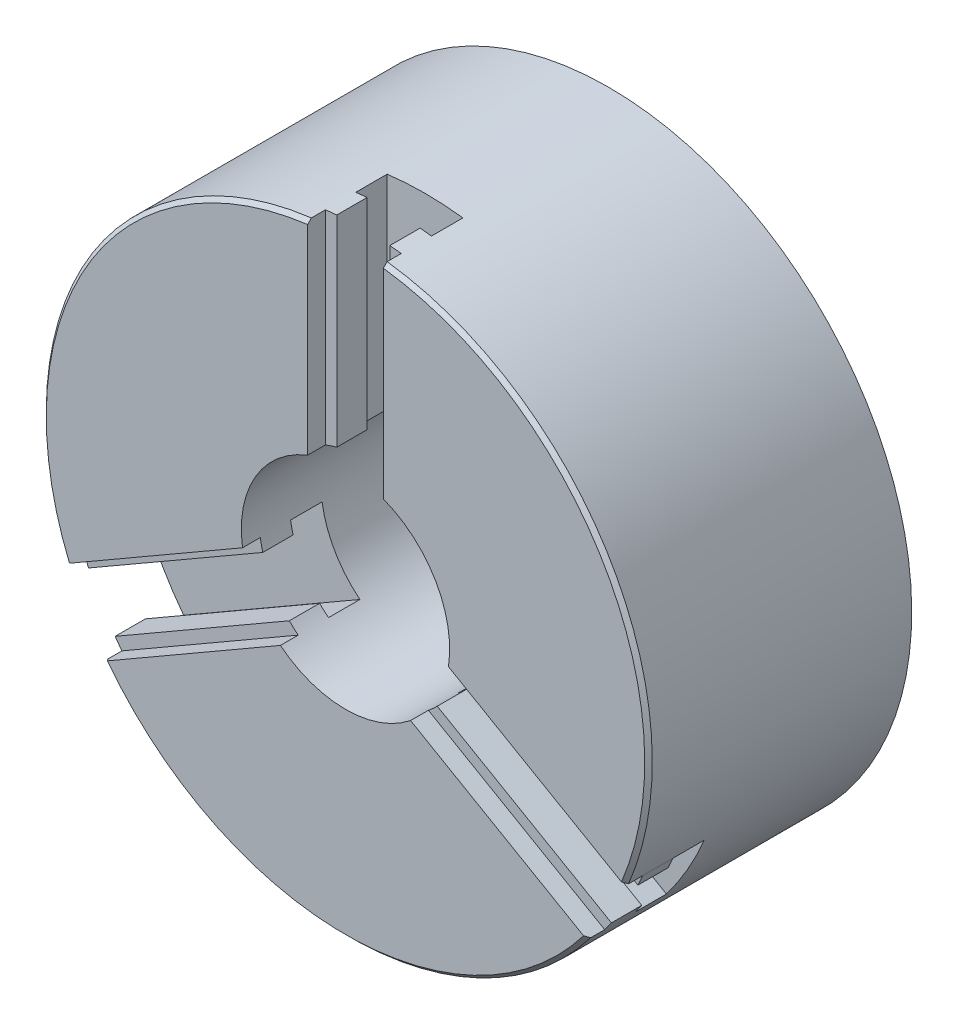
from build123d import *

# Parameters (mm, degrees)
ESQMANDRIN_R                 = 80
ESQMANDRIN_R_2               = 27.5
MANDRIN_DEPTH                = 73.5
GLISSIERE_REACH              = 136.916
GLISSIERE_END_RADIUS         = 80
R_P_TITION_CIRCULAIRE1_COUNT = 3
CHANFREIN1_SIZE              = 1
ENL_V_START                  = -4
ESQUISSE1_R                  = 80
ENL_V_MAT_EXTRU_1_DEPTH      = 4
TROU_TARAUD_M61_D            = 5
TROU_TARAUD_M61_DEPTH        = 17
TROU_TARAUD_M61_CSINK_D      = 6.05
TROU_TARAUD_M61_CSINK_ANGLE  = 70
TROU_TARAUD_M61_TIP          = 1.502151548


with BuildPart() as part:
    # EsqMandrin → Mandrin (new body)
    with BuildSketch(Plane.XY):
        Circle(ESQMANDRIN_R)
        Circle(ESQMANDRIN_R_2, mode=Mode.SUBTRACT)
    extrude(amount=-MANDRIN_DEPTH)

    # Glissiere: up to this cylinder (the profile starts inside it)
    glissiere_end = Plane(origin=(0, 0, -5.231469), z_dir=(0, 0, 1)) * Cylinder(GLISSIERE_END_RADIUS, 434.832, mode=Mode.PRIVATE)
    # EsqGlissiere → Glissiere (cut, up to the surface)
    with BuildSketch(Plane(origin=(0, 0, 0), x_dir=(1, 0, 0), z_dir=(0, 1, 0)), mode=Mode.PRIVATE) as glissiere_sk1:
        Polygon((10, 12.7), (7, 12.7), (7, 4.7), (10, 4.7), (10, -10), (-10, -10), (-10, 4.7), (-7, 4.7), (-7, 12.7), (-10, 12.7), (-10, 21), (10, 21), align=None)
    glissiere_tool1 = extrude(glissiere_sk1.sketch, amount=GLISSIERE_REACH, mode=Mode.PRIVATE) & glissiere_end
    glissiere = glissiere_tool1.solids().sort_by_distance((0, 0, -5.231469))[0]
    add(glissiere, mode=Mode.SUBTRACT)

    # R_p_tition circulaire1: Glissiere ×3 about axis
    r_p_tition_circulaire1_axis = Axis((0, 0, 0), (0, 0, 1))
    for i in range(1, R_P_TITION_CIRCULAIRE1_COUNT):
        add(glissiere.rotate(r_p_tition_circulaire1_axis, i * 360 / R_P_TITION_CIRCULAIRE1_COUNT), mode=Mode.SUBTRACT)

    # Chanfrein1
    chanfrein1_edges = [part.edges().sort_by_distance(p)[0] for p in [
        (-69.282032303, 40, 0),
        (0, -80, 0),
        (60, 52.915026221, 0),
    ]]
    chamfer(chanfrein1_edges, length=CHANFREIN1_SIZE)

    # Esquisse1 → Enl_v. mat.-Extru.1 (cut)
    with BuildSketch(Plane(origin=(0, 0, -73.5), x_dir=(-1, 0, 0), z_dir=(0, 0, -1)).offset(ENL_V_START)):
        with Locations(Location((0, 0, 0), (0, 0, 202.819244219))):
            Circle(ESQUISSE1_R)
    extrude(amount=ENL_V_MAT_EXTRU_1_DEPTH, mode=Mode.SUBTRACT)

    # Trou taraud_ M61
    with Locations(Plane(origin=(0, 0, -69.5), x_dir=(-1, 0, 0), z_dir=(0, 0, -1))):
        with Locations((-50, 0), (0, -50), (50, 0), (0, 50)):
            CounterSinkHole(TROU_TARAUD_M61_D / 2, TROU_TARAUD_M61_CSINK_D / 2, depth=TROU_TARAUD_M61_DEPTH, counter_sink_angle=TROU_TARAUD_M61_CSINK_ANGLE)
            with Locations((0, 0, -(TROU_TARAUD_M61_DEPTH + TROU_TARAUD_M61_TIP / 2))):  # 118° drill point
                Cone(0, TROU_TARAUD_M61_D / 2, TROU_TARAUD_M61_TIP, mode=Mode.SUBTRACT)


solid = part.part
